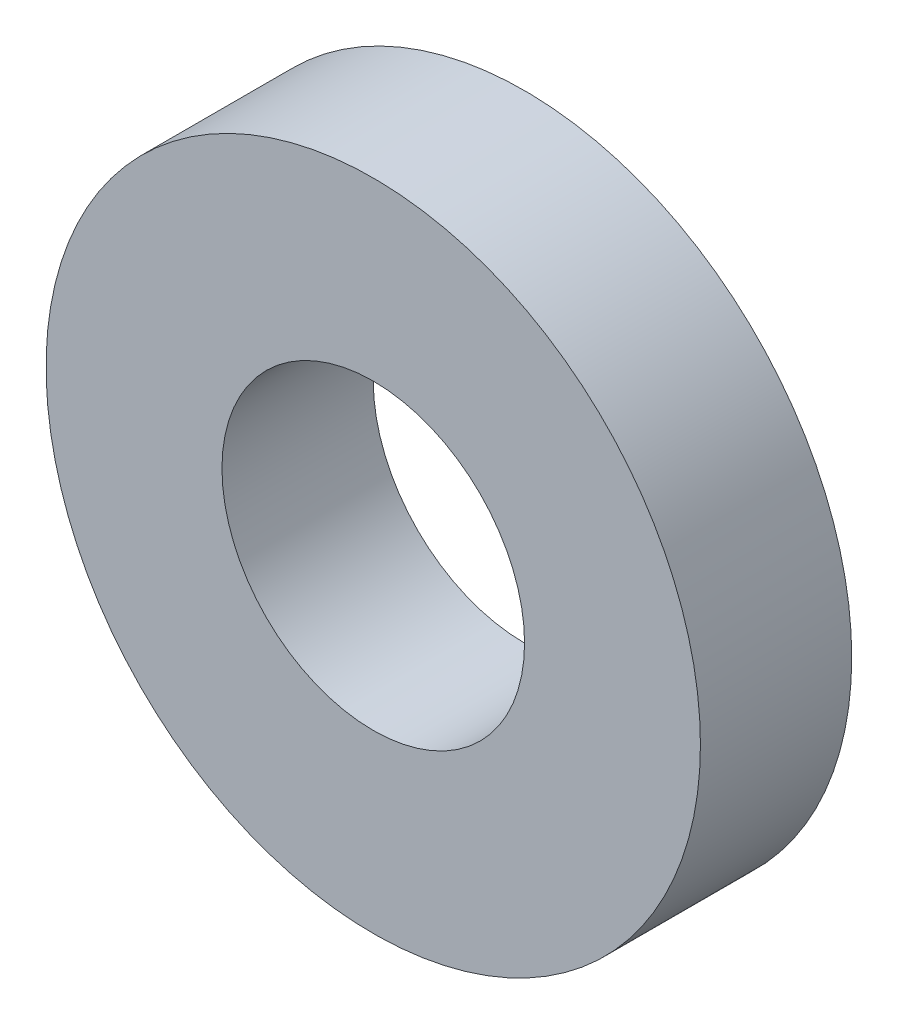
from build123d import *

# Parameters (mm, degrees)
ESQUISSE1_R          = 12.975
ESQUISSE1_R_2        = 6
BASE_EXTRUSION_DEPTH = 3


with BuildPart() as part:
    # Esquisse1 → Base-Extrusion (new, symmetric)
    with BuildSketch(Plane.XY):
        Circle(ESQUISSE1_R)
        Circle(ESQUISSE1_R_2, mode=Mode.SUBTRACT)
    extrude(amount=BASE_EXTRUSION_DEPTH, both=True)


solid = part.part
